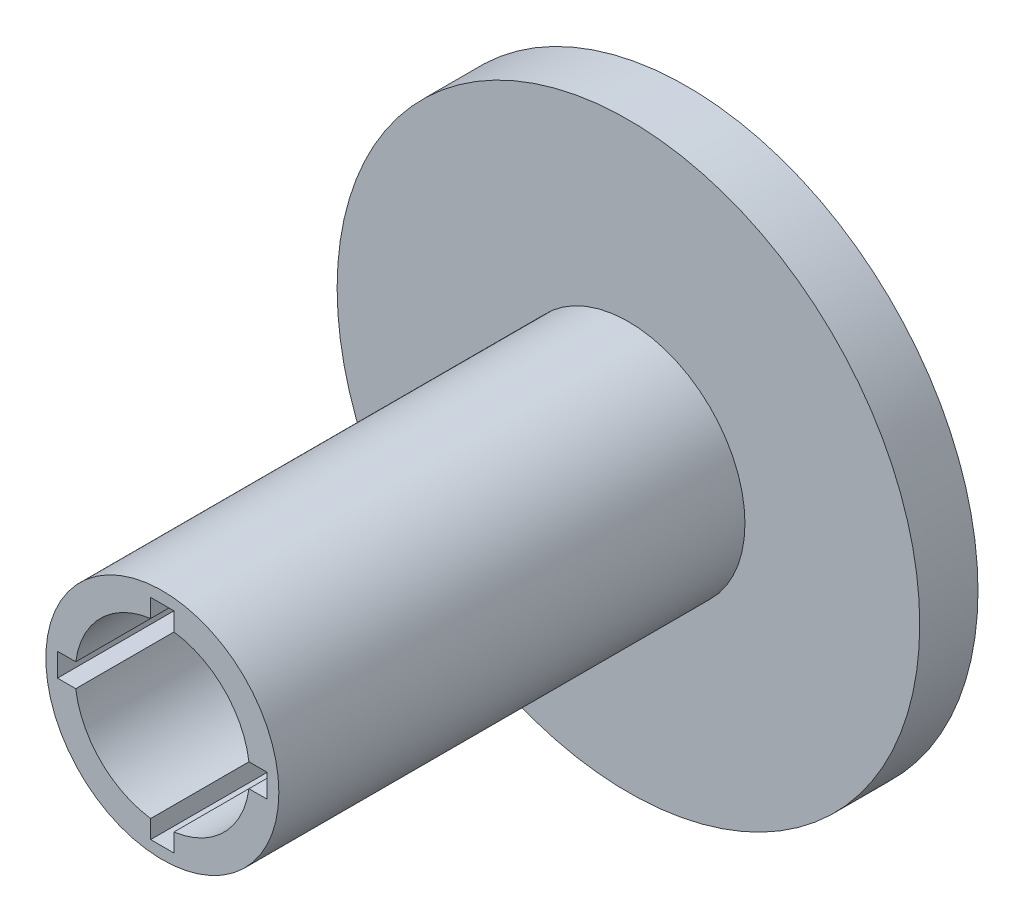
from build123d import *

# Parameters (mm, degrees)
SKETCH_2_R          = 50
EXTRUDE_1_DEPTH     = 10
SKETCH_3_R          = 20
EXTRUDE_2_DEPTH     = 80
SKETCH_4_R          = 15
CUT_EXTRUDE_1_DEPTH = 80
SKETCH_5_W          = 4
SKETCH_5_H          = 4
CUT_EXTRUDE_2_DEPTH = 80
CUT_EXTRUDE_3_DEPTH = 6
CUT_EXTRUDE_4_DEPTH = 4


with BuildPart() as part:
    # Sketch 2 → Extrude 1 (new body)
    with BuildSketch(Plane.XY):
        Circle(SKETCH_2_R)
    extrude(amount=EXTRUDE_1_DEPTH)

    # Sketch 3 → Extrude 2 (add)
    with BuildSketch(Plane.XY.offset(10)):
        Circle(SKETCH_3_R)
    extrude(amount=EXTRUDE_2_DEPTH)

    # Sketch 4 → Cut-Extrude 1 (cut)
    with BuildSketch(Plane.XY.offset(90)):
        Circle(SKETCH_4_R)
    extrude(amount=-CUT_EXTRUDE_1_DEPTH, mode=Mode.SUBTRACT)

    # Sketch 5 → Cut-Extrude 2 (cut)
    with BuildSketch(Plane.XY.offset(90)):
        with BuildLine():
            Line((-18, -2), (-14.866068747, -2))
            ThreePointArc((-14.866068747, -2), (-15, 0), (-14.866068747, 2))
            Line((-14.866068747, 2), (-18, 2))
            Line((-18, 2), (-18, -2))
        make_face()
        with BuildLine():
            Line((-14.866068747, -2), (-2, -2))
            Line((-2, -2), (-2, 2))
            Line((-2, 2), (-14.866068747, 2))
            ThreePointArc((-14.866068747, 2), (-15, 0), (-14.866068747, -2))
        make_face()
        with BuildLine():
            Line((2, 2), (2, -2))
            Line((2, -2), (14.866068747, -2))
            ThreePointArc((14.866068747, -2), (14.966479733, -1.002239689), (15, 0))
            ThreePointArc((15, 0), (14.966479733, 1.002239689), (14.866068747, 2))
            Line((14.866068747, 2), (2, 2))
        make_face()
        Rectangle(SKETCH_5_W, SKETCH_5_H)
        with BuildLine():
            Line((-2, 14.866068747), (-2, 2))
            Line((-2, 2), (2, 2))
            Line((2, 2), (2, 14.866068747))
            ThreePointArc((2, 14.866068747), (0, 15), (-2, 14.866068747))
        make_face()
        with BuildLine():
            Line((-2, 18), (-2, 14.866068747))
            ThreePointArc((-2, 14.866068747), (0, 15), (2, 14.866068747))
            Line((2, 14.866068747), (2, 18))
            Line((2, 18), (-2, 18))
        make_face()
        with BuildLine():
            ThreePointArc((15, 0), (14.966479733, -1.002239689), (14.866068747, -2))
            Line((14.866068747, -2), (18, -2))
            Line((18, -2), (18, 2))
            Line((18, 2), (14.866068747, 2))
            ThreePointArc((14.866068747, 2), (14.966479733, 1.002239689), (15, 0))
        make_face()
        with BuildLine():
            Line((-2, -2), (-2, -14.866068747))
            ThreePointArc((-2, -14.866068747), (0, -15), (2, -14.866068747))
            Line((2, -14.866068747), (2, -2))
            Line((2, -2), (-2, -2))
        make_face()
        with BuildLine():
            Line((-2, -14.866068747), (-2, -18))
            Line((-2, -18), (2, -18))
            Line((2, -18), (2, -14.866068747))
            ThreePointArc((2, -14.866068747), (0, -15), (-2, -14.866068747))
        make_face()
    extrude(amount=-CUT_EXTRUDE_2_DEPTH, mode=Mode.SUBTRACT)

    # Sketch 6 → Cut-Extrude 3 (cut)
    with BuildSketch(Plane(origin=(0, 0, 0), x_dir=(-1, 0, 0), z_dir=(0, 0, -1))):
        with BuildLine():
            Line((-2, -17.5), (2, -17.5))
            Line((2, -17.5), (2, -9.797958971))
            ThreePointArc((2, -9.797958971), (7.071067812, -7.071067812), (9.797958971, -2))
            Line((9.797958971, -2), (17.5, -2))
            Line((17.5, -2), (17.5, 2))
            Line((17.5, 2), (9.797958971, 2))
            ThreePointArc((9.797958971, 2), (7.071067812, 7.071067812), (2, 9.797958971))
            Line((2, 9.797958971), (2, 17.5))
            Line((2, 17.5), (-2, 17.5))
            Line((-2, 17.5), (-2, 9.797958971))
            ThreePointArc((-2, 9.797958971), (-7.071067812, 7.071067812), (-9.797958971, 2))
            Line((-9.797958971, 2), (-17.5, 2))
            Line((-17.5, 2), (-17.5, -2))
            Line((-17.5, -2), (-9.797958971, -2))
            ThreePointArc((-9.797958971, -2), (-7.071067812, -7.071067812), (-2, -9.797958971))
            Line((-2, -9.797958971), (-2, -17.5))
        make_face()
    extrude(amount=-CUT_EXTRUDE_3_DEPTH, mode=Mode.SUBTRACT)

    # Sketch 7 → Cut-Extrude 4 (cut)
    with BuildSketch(Plane(origin=(0, 0, 6), x_dir=(-1, 0, 0), z_dir=(0, 0, -1))):
        with BuildLine():
            Line((-3.033150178, -4.1), (3.033150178, -4.1))
            ThreePointArc((3.033150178, -4.1), (0, 5.1), (-3.033150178, -4.1))
        make_face()
    extrude(amount=-CUT_EXTRUDE_4_DEPTH, mode=Mode.SUBTRACT)


solid = part.part
